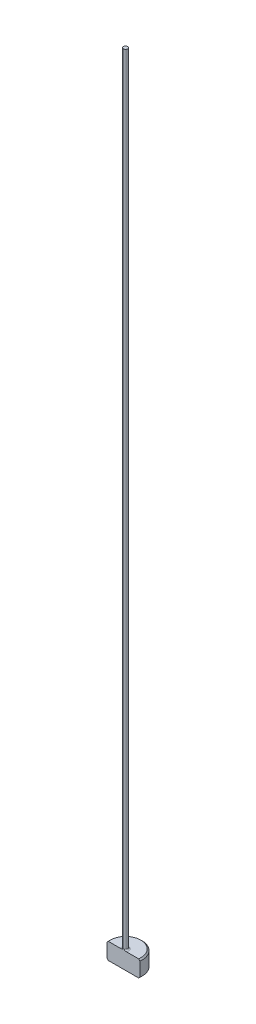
from build123d import *

# Parameters (mm, degrees)
CHAMFER1_SIZE = 0.254
FILLET1_R     = 0.254
KEY_DEPTH     = 153.466131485


with BuildPart() as part:
    # Sketch1 → Revolve1 (revolve)
    with BuildSketch(Plane.XY, mode=Mode.PRIVATE) as revolve1_sk:
        Polygon((0, 0), (-3.175, 0), (-3.175, 3.175), (-0.39624, 3.175), (-0.39624, 152.4), (0, 152.4), align=None)
    revolve(revolve1_sk.sketch.rotate(Axis((0, 259.958771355, 0), (0, -1, 0)), 270), axis=Axis((0, 259.958771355, 0), (0, -1, 0)))

    # Chamfer1
    chamfer1_edges = [part.edges().sort_by_distance(p)[0] for p in [
        (0, 3.175, -3.175),
        (0, 0, -3.175),
    ]]
    chamfer(chamfer1_edges, length=CHAMFER1_SIZE)

    # Fillet1
    fillet1_edges = [part.edges().sort_by_distance(p)[0] for p in [
        (0, 3.175, -0.39624),
    ]]
    fillet(fillet1_edges, radius=FILLET1_R)

    # Sketch2 → Key (cut, through all)
    with BuildSketch(Plane(origin=(0, 0, 0), x_dir=(1, 0, 0), z_dir=(0, 1, 0))):
        with BuildLine():
            Line((-3.150177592, -0.39624), (3.150177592, -0.39624))
            ThreePointArc((3.150177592, -0.39624), (0, -3.175), (-3.150177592, -0.39624))
        make_face()
    extrude(amount=KEY_DEPTH, mode=Mode.SUBTRACT)


solid = part.part
